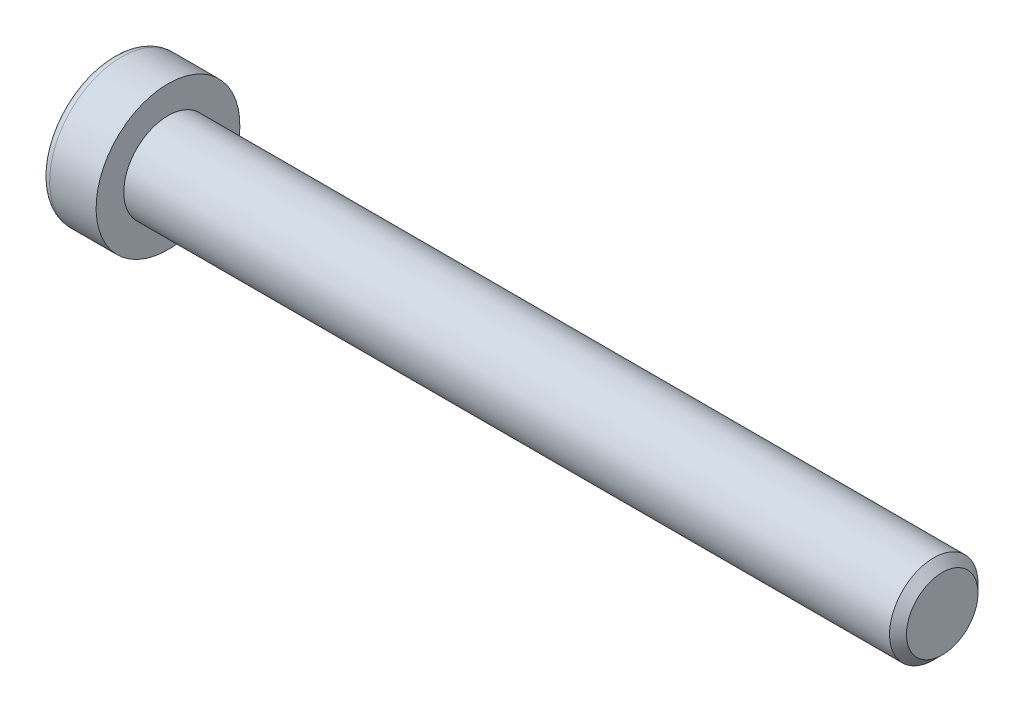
ISO-10303-21;
HEADER;
FILE_DESCRIPTION(('STEP AP214'),'2;1');
FILE_NAME('part.step','',(''),(''),'','','');
FILE_SCHEMA(('AUTOMOTIVE_DESIGN { 1 0 10303 214 1 1 1 1 }'));
ENDSEC;
DATA;
#1=APPLICATION_CONTEXT('core data for automotive mechanical design processes');
#2=APPLICATION_PROTOCOL_DEFINITION('international standard','automotive_design',2000,#1);
#3=PRODUCT_CONTEXT('',#1,'mechanical');
#4=PRODUCT('Part','Part','',(#3));
#5=PRODUCT_RELATED_PRODUCT_CATEGORY('part','',(#4));
#6=PRODUCT_DEFINITION_FORMATION('','',#4);
#7=PRODUCT_DEFINITION_CONTEXT('part definition',#1,'design');
#8=PRODUCT_DEFINITION('design','',#6,#7);
#9=PRODUCT_DEFINITION_SHAPE('','',#8);
#10=(LENGTH_UNIT() NAMED_UNIT(*) SI_UNIT(.MILLI.,.METRE.));
#11=(NAMED_UNIT(*) PLANE_ANGLE_UNIT() SI_UNIT($,.RADIAN.));
#12=(NAMED_UNIT(*) SI_UNIT($,.STERADIAN.) SOLID_ANGLE_UNIT());
#13=UNCERTAINTY_MEASURE_WITH_UNIT(LENGTH_MEASURE(1.E-05),#10,'distance_accuracy_value','');
#14=(GEOMETRIC_REPRESENTATION_CONTEXT(3) GLOBAL_UNCERTAINTY_ASSIGNED_CONTEXT((#13)) GLOBAL_UNIT_ASSIGNED_CONTEXT((#10,
#11,#12)) REPRESENTATION_CONTEXT('',''));
#15=CARTESIAN_POINT('',(0.,0.,0.));
#16=DIRECTION('',(0.,0.,1.));
#17=DIRECTION('',(1.,0.,0.));
#18=AXIS2_PLACEMENT_3D('',#15,#16,#17);
#19=CARTESIAN_POINT('',(-1.21000000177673,0.,0.));
#20=DIRECTION('',(-1.,0.,0.));
#21=DIRECTION('',(0.,0.,1.));
#22=AXIS2_PLACEMENT_3D('',#19,#20,#21);
#23=CONICAL_SURFACE('',#22,2.9040718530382,1.04719754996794);
#24=CARTESIAN_POINT('',(0.466666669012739,-1.13686837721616E-10,0.));
#25=VERTEX_POINT('',#24);
#26=VERTEX_LOOP('',#25);
#27=FACE_BOUND('',#26,.T.);
#28=CARTESIAN_POINT('',(-1.20000000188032,2.50000000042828,1.44337567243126));
#29=CARTESIAN_POINT('',(-1.16336943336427,2.50000000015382,1.31652043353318));
#30=CARTESIAN_POINT('',(-1.13005584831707,2.50000000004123,1.18857018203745));
#31=CARTESIAN_POINT('',(-1.07190798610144,2.49999999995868,0.930454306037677));
#32=CARTESIAN_POINT('',(-1.04709427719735,2.49999999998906,0.800284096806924));
#33=CARTESIAN_POINT('',(-1.00846995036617,2.50000000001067,0.541556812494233));
#34=CARTESIAN_POINT('',(-0.994402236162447,2.50000000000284,0.413039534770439));
#35=CARTESIAN_POINT('',(-0.977611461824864,2.49999999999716,0.155400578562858));
#36=CARTESIAN_POINT('',(-0.974874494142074,2.49999999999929,0.0262798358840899));
#37=CARTESIAN_POINT('',(-0.980582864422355,2.50000000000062,-0.21496841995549));
#38=CARTESIAN_POINT('',(-0.987626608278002,2.50000000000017,-0.327132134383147));
#39=CARTESIAN_POINT('',(-1.00994662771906,2.49999999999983,-0.550728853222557));
#40=CARTESIAN_POINT('',(-1.02523052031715,2.49999999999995,-0.66216108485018));
#41=CARTESIAN_POINT('',(-1.06343729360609,2.50000000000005,-0.886218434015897));
#42=CARTESIAN_POINT('',(-1.08652205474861,2.50000000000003,-0.998815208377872));
#43=CARTESIAN_POINT('',(-1.13891470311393,2.49999999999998,-1.2223298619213));
#44=CARTESIAN_POINT('',(-1.16821028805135,2.49999999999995,-1.33325060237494));
#45=CARTESIAN_POINT('',(-1.20000000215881,2.5,-1.44337567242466));
#46=B_SPLINE_CURVE_WITH_KNOTS('',3,(#28,#29,#30,#31,#32,#33,#34,#35,#36,#37,#38,#39,#40,#41,#42,
#43,#44,#45),.UNSPECIFIED.,.F.,.F.,(4,2,2,2,2,2,2,2,4),(0.,0.396270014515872,0.793492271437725,
1.18088450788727,1.56780111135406,1.90463472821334,2.24178024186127,2.58640202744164,
2.93034746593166),.UNSPECIFIED.);
#47=CARTESIAN_POINT('',(-1.20000000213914,2.49999999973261,1.44337567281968));
#48=VERTEX_POINT('',#47);
#49=CARTESIAN_POINT('',(-1.20000000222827,2.5,-1.44337567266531));
#50=VERTEX_POINT('',#49);
#51=EDGE_CURVE('E20',#48,#50,#46,.T.);
#52=ORIENTED_EDGE('',*,*,#51,.T.);
#53=CARTESIAN_POINT('',(-1.20000000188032,2.49999999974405,-1.44337567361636));
#54=CARTESIAN_POINT('',(-1.16336943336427,2.39014014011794,-1.50680329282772));
#55=CARTESIAN_POINT('',(-1.13005584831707,2.27933197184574,-1.57077841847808));
#56=CARTESIAN_POINT('',(-1.07190798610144,2.05579706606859,-1.69983635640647));
#57=CARTESIAN_POINT('',(-1.04709427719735,1.94306635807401,-1.76492146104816));
#58=CARTESIAN_POINT('',(-1.00846995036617,1.71900195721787,-1.89428510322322));
#59=CARTESIAN_POINT('',(-0.994402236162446,1.60770272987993,-1.95854374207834));
#60=CARTESIAN_POINT('',(-0.977611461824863,1.38458084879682,-2.08736322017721));
#61=CARTESIAN_POINT('',(-0.974874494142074,1.27275900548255,-2.15192359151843));
#62=CARTESIAN_POINT('',(-0.980582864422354,1.06383188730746,-2.27254771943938));
#63=CARTESIAN_POINT('',(-0.987626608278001,0.966695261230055,-2.32862957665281));
#64=CARTESIAN_POINT('',(-1.00994662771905,0.773054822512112,-2.44042793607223));
#65=CARTESIAN_POINT('',(-1.02523052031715,0.676551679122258,-2.49614405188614));
#66=CARTESIAN_POINT('',(-1.06343729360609,0.482512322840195,-2.60817272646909));
#67=CARTESIAN_POINT('',(-1.08652205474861,0.385000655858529,-2.66447111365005));
#68=CARTESIAN_POINT('',(-1.13891470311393,0.191431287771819,-2.77622844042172));
#69=CARTESIAN_POINT('',(-1.16821028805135,0.09537110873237,-2.83168881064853));
#70=CARTESIAN_POINT('',(-1.20000000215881,4.75795614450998E-10,-2.88675134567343));
#71=B_SPLINE_CURVE_WITH_KNOTS('',3,(#53,#54,#55,#56,#57,#58,#59,#60,#61,#62,#63,#64,#65,#66,#67,
#68,#69,#70),.UNSPECIFIED.,.F.,.F.,(4,2,2,2,2,2,2,2,4),(0.,0.396270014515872,0.793492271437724,
1.18088450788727,1.56780111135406,1.90463472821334,2.24178024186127,2.58640202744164,
2.93034746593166),.UNSPECIFIED.);
#72=CARTESIAN_POINT('',(-1.20000000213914,0.,-2.88675134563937));
#73=VERTEX_POINT('',#72);
#74=EDGE_CURVE('E80',#50,#73,#71,.T.);
#75=ORIENTED_EDGE('',*,*,#74,.T.);
#76=CARTESIAN_POINT('',(-1.20000000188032,-6.84219602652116E-10,-2.88675134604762));
#77=CARTESIAN_POINT('',(-1.16336943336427,-0.109859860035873,-2.8233237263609));
#78=CARTESIAN_POINT('',(-1.13005584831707,-0.220668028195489,-2.75934860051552));
#79=CARTESIAN_POINT('',(-1.07190798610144,-0.444202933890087,-2.63029066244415));
#80=CARTESIAN_POINT('',(-1.04709427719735,-0.556933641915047,-2.56520555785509));
#81=CARTESIAN_POINT('',(-1.00846995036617,-0.780998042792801,-2.43584191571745));
#82=CARTESIAN_POINT('',(-0.994402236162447,-0.892297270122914,-2.37158327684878));
#83=CARTESIAN_POINT('',(-0.977611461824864,-1.11541915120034,-2.24276379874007));
#84=CARTESIAN_POINT('',(-0.974874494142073,-1.22724099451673,-2.17820342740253));
#85=CARTESIAN_POINT('',(-0.980582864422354,-1.43616811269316,-2.05757929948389));
#86=CARTESIAN_POINT('',(-0.987626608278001,-1.53330473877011,-2.00149744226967));
#87=CARTESIAN_POINT('',(-1.00994662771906,-1.72694517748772,-1.88969908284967));
#88=CARTESIAN_POINT('',(-1.02523052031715,-1.82344832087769,-1.83398296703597));
#89=CARTESIAN_POINT('',(-1.06343729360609,-2.01748767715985,-1.72195429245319));
#90=CARTESIAN_POINT('',(-1.08652205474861,-2.1149993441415,-1.66565590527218));
#91=CARTESIAN_POINT('',(-1.13891470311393,-2.30856871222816,-1.55389857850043));
#92=CARTESIAN_POINT('',(-1.16821028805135,-2.40462889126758,-1.49843820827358));
#93=CARTESIAN_POINT('',(-1.20000000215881,-2.49999999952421,-1.44337567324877));
#94=B_SPLINE_CURVE_WITH_KNOTS('',3,(#76,#77,#78,#79,#80,#81,#82,#83,#84,#85,#86,#87,#88,#89,#90,
#91,#92,#93),.UNSPECIFIED.,.F.,.F.,(4,2,2,2,2,2,2,2,4),(0.,0.396270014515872,0.793492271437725,
1.18088450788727,1.56780111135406,1.90463472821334,2.24178024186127,2.58640202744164,
2.93034746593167),.UNSPECIFIED.);
#95=CARTESIAN_POINT('',(-1.20000000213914,-2.49999999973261,-1.44337567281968));
#96=VERTEX_POINT('',#95);
#97=EDGE_CURVE('E105',#73,#96,#94,.T.);
#98=ORIENTED_EDGE('',*,*,#97,.T.);
#99=CARTESIAN_POINT('',(-1.20000000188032,-2.50000000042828,-1.44337567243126));
#100=CARTESIAN_POINT('',(-1.16336943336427,-2.50000000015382,-1.31652043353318));
#101=CARTESIAN_POINT('',(-1.13005584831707,-2.50000000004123,-1.18857018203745));
#102=CARTESIAN_POINT('',(-1.07190798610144,-2.49999999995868,-0.93045430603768));
#103=CARTESIAN_POINT('',(-1.04709427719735,-2.49999999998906,-0.800284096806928));
#104=CARTESIAN_POINT('',(-1.00846995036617,-2.50000000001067,-0.541556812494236));
#105=CARTESIAN_POINT('',(-0.994402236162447,-2.50000000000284,-0.413039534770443));
#106=CARTESIAN_POINT('',(-0.977611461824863,-2.49999999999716,-0.155400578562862));
#107=CARTESIAN_POINT('',(-0.974874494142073,-2.49999999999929,-0.0262798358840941));
#108=CARTESIAN_POINT('',(-0.980582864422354,-2.50000000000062,0.214968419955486));
#109=CARTESIAN_POINT('',(-0.987626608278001,-2.50000000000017,0.327132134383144));
#110=CARTESIAN_POINT('',(-1.00994662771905,-2.49999999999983,0.550728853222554));
#111=CARTESIAN_POINT('',(-1.02523052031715,-2.49999999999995,0.662161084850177));
#112=CARTESIAN_POINT('',(-1.06343729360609,-2.50000000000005,0.886218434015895));
#113=CARTESIAN_POINT('',(-1.08652205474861,-2.50000000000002,0.99881520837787));
#114=CARTESIAN_POINT('',(-1.13891470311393,-2.49999999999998,1.2223298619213));
#115=CARTESIAN_POINT('',(-1.16821028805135,-2.49999999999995,1.33325060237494));
#116=CARTESIAN_POINT('',(-1.20000000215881,-2.5,1.44337567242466));
#117=B_SPLINE_CURVE_WITH_KNOTS('',3,(#99,#100,#101,#102,#103,#104,#105,#106,#107,#108,#109,#110,
#111,#112,#113,#114,#115,#116),.UNSPECIFIED.,.F.,.F.,(4,2,2,2,2,2,2,2,4),(0.,0.396270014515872,
0.793492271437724,1.18088450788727,1.56780111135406,1.90463472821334,2.24178024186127,
2.58640202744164,2.93034746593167),.UNSPECIFIED.);
#118=CARTESIAN_POINT('',(-1.20000000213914,-2.49999999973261,1.44337567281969));
#119=VERTEX_POINT('',#118);
#120=EDGE_CURVE('E129',#96,#119,#117,.T.);
#121=ORIENTED_EDGE('',*,*,#120,.T.);
#122=CARTESIAN_POINT('',(-1.20000000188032,-2.49999999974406,1.44337567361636));
#123=CARTESIAN_POINT('',(-1.16336943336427,-2.39014014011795,1.50680329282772));
#124=CARTESIAN_POINT('',(-1.13005584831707,-2.27933197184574,1.57077841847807));
#125=CARTESIAN_POINT('',(-1.07190798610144,-2.05579706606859,1.69983635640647));
#126=CARTESIAN_POINT('',(-1.04709427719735,-1.94306635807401,1.76492146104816));
#127=CARTESIAN_POINT('',(-1.00846995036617,-1.71900195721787,1.89428510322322));
#128=CARTESIAN_POINT('',(-0.994402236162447,-1.60770272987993,1.95854374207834));
#129=CARTESIAN_POINT('',(-0.977611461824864,-1.38458084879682,2.08736322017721));
#130=CARTESIAN_POINT('',(-0.974874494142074,-1.27275900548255,2.15192359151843));
#131=CARTESIAN_POINT('',(-0.980582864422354,-1.06383188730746,2.27254771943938));
#132=CARTESIAN_POINT('',(-0.987626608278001,-0.966695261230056,2.32862957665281));
#133=CARTESIAN_POINT('',(-1.00994662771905,-0.773054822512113,2.44042793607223));
#134=CARTESIAN_POINT('',(-1.02523052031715,-0.676551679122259,2.49614405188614));
#135=CARTESIAN_POINT('',(-1.06343729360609,-0.482512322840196,2.60817272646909));
#136=CARTESIAN_POINT('',(-1.08652205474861,-0.385000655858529,2.66447111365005));
#137=CARTESIAN_POINT('',(-1.13891470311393,-0.19143128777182,2.77622844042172));
#138=CARTESIAN_POINT('',(-1.16821028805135,-0.0953711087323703,2.83168881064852));
#139=CARTESIAN_POINT('',(-1.20000000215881,-4.75795563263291E-10,2.88675134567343));
#140=B_SPLINE_CURVE_WITH_KNOTS('',3,(#122,#123,#124,#125,#126,#127,#128,#129,#130,#131,#132,
#133,#134,#135,#136,#137,#138,#139),.UNSPECIFIED.,.F.,.F.,(4,2,2,2,2,2,2,2,4),(0.,
0.396270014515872,0.793492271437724,1.18088450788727,1.56780111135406,1.90463472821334,
2.24178024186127,2.58640202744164,2.93034746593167),.UNSPECIFIED.);
#141=CARTESIAN_POINT('',(-1.20000000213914,0.,2.88675134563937));
#142=VERTEX_POINT('',#141);
#143=EDGE_CURVE('E137',#119,#142,#140,.T.);
#144=ORIENTED_EDGE('',*,*,#143,.T.);
#145=CARTESIAN_POINT('',(-1.20000000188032,6.84218567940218E-10,2.88675134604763));
#146=CARTESIAN_POINT('',(-1.16336943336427,0.109859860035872,2.8233237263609));
#147=CARTESIAN_POINT('',(-1.13005584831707,0.220668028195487,2.75934860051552));
#148=CARTESIAN_POINT('',(-1.07190798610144,0.444202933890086,2.63029066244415));
#149=CARTESIAN_POINT('',(-1.04709427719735,0.556933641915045,2.56520555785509));
#150=CARTESIAN_POINT('',(-1.00846995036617,0.7809980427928,2.43584191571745));
#151=CARTESIAN_POINT('',(-0.994402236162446,0.892297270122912,2.37158327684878));
#152=CARTESIAN_POINT('',(-0.977611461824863,1.11541915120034,2.24276379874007));
#153=CARTESIAN_POINT('',(-0.974874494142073,1.22724099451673,2.17820342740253));
#154=CARTESIAN_POINT('',(-0.980582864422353,1.43616811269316,2.05757929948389));
#155=CARTESIAN_POINT('',(-0.987626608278,1.53330473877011,2.00149744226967));
#156=CARTESIAN_POINT('',(-1.00994662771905,1.72694517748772,1.88969908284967));
#157=CARTESIAN_POINT('',(-1.02523052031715,1.82344832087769,1.83398296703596));
#158=CARTESIAN_POINT('',(-1.06343729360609,2.01748767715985,1.72195429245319));
#159=CARTESIAN_POINT('',(-1.08652205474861,2.1149993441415,1.66565590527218));
#160=CARTESIAN_POINT('',(-1.13891470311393,2.30856871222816,1.55389857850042));
#161=CARTESIAN_POINT('',(-1.16821028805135,2.40462889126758,1.49843820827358));
#162=CARTESIAN_POINT('',(-1.2000000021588,2.49999999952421,1.44337567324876));
#163=B_SPLINE_CURVE_WITH_KNOTS('',3,(#145,#146,#147,#148,#149,#150,#151,#152,#153,#154,#155,
#156,#157,#158,#159,#160,#161,#162),.UNSPECIFIED.,.F.,.F.,(4,2,2,2,2,2,2,2,4),(0.,
0.396270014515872,0.793492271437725,1.18088450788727,1.56780111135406,1.90463472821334,
2.24178024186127,2.58640202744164,2.93034746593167),.UNSPECIFIED.);
#164=EDGE_CURVE('E82',#142,#48,#163,.T.);
#165=ORIENTED_EDGE('',*,*,#164,.T.);
#166=EDGE_LOOP('',(#52,#75,#98,#121,#144,#165));
#167=FACE_BOUND('',#166,.T.);
#168=ADVANCED_FACE('F16',(#27,#167),#23,.F.);
#169=CARTESIAN_POINT('',(-5.,2.5,1.44337567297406));
#170=DIRECTION('',(0.,1.,0.));
#171=DIRECTION('',(0.,0.,1.));
#172=AXIS2_PLACEMENT_3D('',#169,#170,#171);
#173=PLANE('',#172);
#174=DIRECTION('',(1.,0.,0.));
#175=VECTOR('',#174,1.);
#176=CARTESIAN_POINT('',(-5.,2.5,1.44337567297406));
#177=LINE('',#176,#175);
#178=CARTESIAN_POINT('',(-5.,2.5,1.44337567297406));
#179=VERTEX_POINT('',#178);
#180=EDGE_CURVE('E84',#48,#179,#177,.F.);
#181=ORIENTED_EDGE('',*,*,#180,.T.);
#182=DIRECTION('',(0.,0.,1.));
#183=VECTOR('',#182,1.);
#184=CARTESIAN_POINT('',(-5.,2.5,0.));
#185=LINE('',#184,#183);
#186=CARTESIAN_POINT('',(-5.,2.5,-1.44337567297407));
#187=VERTEX_POINT('',#186);
#188=EDGE_CURVE('E89',#187,#179,#185,.T.);
#189=ORIENTED_EDGE('',*,*,#188,.F.);
#190=DIRECTION('',(1.,0.,0.));
#191=VECTOR('',#190,1.);
#192=CARTESIAN_POINT('',(-5.,2.5,-1.44337567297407));
#193=LINE('',#192,#191);
#194=EDGE_CURVE('E87',#187,#50,#193,.T.);
#195=ORIENTED_EDGE('',*,*,#194,.T.);
#196=ORIENTED_EDGE('',*,*,#51,.F.);
#197=EDGE_LOOP('',(#181,#189,#195,#196));
#198=FACE_BOUND('',#197,.T.);
#199=ADVANCED_FACE('F76',(#198),#173,.F.);
#200=CARTESIAN_POINT('',(-5.,0.,2.88675134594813));
#201=DIRECTION('',(0.,0.500000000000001,0.866025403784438));
#202=DIRECTION('',(0.,-0.866025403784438,0.500000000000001));
#203=AXIS2_PLACEMENT_3D('',#200,#201,#202);
#204=PLANE('',#203);
#205=DIRECTION('',(1.,0.,0.));
#206=VECTOR('',#205,1.);
#207=CARTESIAN_POINT('',(-5.,0.,2.88675134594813));
#208=LINE('',#207,#206);
#209=CARTESIAN_POINT('',(-5.,0.,2.88675134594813));
#210=VERTEX_POINT('',#209);
#211=EDGE_CURVE('E141',#142,#210,#208,.F.);
#212=ORIENTED_EDGE('',*,*,#211,.T.);
#213=DIRECTION('',(0.,-0.866025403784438,0.500000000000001));
#214=VECTOR('',#213,1.);
#215=CARTESIAN_POINT('',(-5.,2.5,1.44337567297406));
#216=LINE('',#215,#214);
#217=EDGE_CURVE('E95',#179,#210,#216,.T.);
#218=ORIENTED_EDGE('',*,*,#217,.F.);
#219=ORIENTED_EDGE('',*,*,#180,.F.);
#220=ORIENTED_EDGE('',*,*,#164,.F.);
#221=EDGE_LOOP('',(#212,#218,#219,#220));
#222=FACE_BOUND('',#221,.T.);
#223=ADVANCED_FACE('F145',(#222),#204,.F.);
#224=CARTESIAN_POINT('',(-5.,-2.5,1.44337567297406));
#225=DIRECTION('',(0.,-0.5,0.866025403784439));
#226=DIRECTION('',(0.,-0.866025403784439,-0.5));
#227=AXIS2_PLACEMENT_3D('',#224,#225,#226);
#228=PLANE('',#227);
#229=DIRECTION('',(1.,0.,0.));
#230=VECTOR('',#229,1.);
#231=CARTESIAN_POINT('',(-5.,-2.5,1.44337567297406));
#232=LINE('',#231,#230);
#233=CARTESIAN_POINT('',(-5.,-2.5,1.44337567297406));
#234=VERTEX_POINT('',#233);
#235=EDGE_CURVE('E136',#119,#234,#232,.F.);
#236=ORIENTED_EDGE('',*,*,#235,.T.);
#237=DIRECTION('',(0.,-0.866025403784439,-0.5));
#238=VECTOR('',#237,1.);
#239=CARTESIAN_POINT('',(-5.,0.,2.88675134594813));
#240=LINE('',#239,#238);
#241=EDGE_CURVE('E224',#210,#234,#240,.T.);
#242=ORIENTED_EDGE('',*,*,#241,.F.);
#243=ORIENTED_EDGE('',*,*,#211,.F.);
#244=ORIENTED_EDGE('',*,*,#143,.F.);
#245=EDGE_LOOP('',(#236,#242,#243,#244));
#246=FACE_BOUND('',#245,.T.);
#247=ADVANCED_FACE('F125',(#246),#228,.F.);
#248=CARTESIAN_POINT('',(-5.,-2.5,-1.44337567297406));
#249=DIRECTION('',(0.,-1.,0.));
#250=DIRECTION('',(0.,0.,-1.));
#251=AXIS2_PLACEMENT_3D('',#248,#249,#250);
#252=PLANE('',#251);
#253=DIRECTION('',(1.,0.,0.));
#254=VECTOR('',#253,1.);
#255=CARTESIAN_POINT('',(-5.,-2.5,-1.44337567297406));
#256=LINE('',#255,#254);
#257=CARTESIAN_POINT('',(-5.,-2.5,-1.44337567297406));
#258=VERTEX_POINT('',#257);
#259=EDGE_CURVE('E135',#96,#258,#256,.F.);
#260=ORIENTED_EDGE('',*,*,#259,.T.);
#261=DIRECTION('',(0.,0.,1.));
#262=VECTOR('',#261,1.);
#263=CARTESIAN_POINT('',(-5.,-2.5,0.));
#264=LINE('',#263,#262);
#265=EDGE_CURVE('E221',#234,#258,#264,.F.);
#266=ORIENTED_EDGE('',*,*,#265,.F.);
#267=ORIENTED_EDGE('',*,*,#235,.F.);
#268=ORIENTED_EDGE('',*,*,#120,.F.);
#269=EDGE_LOOP('',(#260,#266,#267,#268));
#270=FACE_BOUND('',#269,.T.);
#271=ADVANCED_FACE('F121',(#270),#252,.F.);
#272=CARTESIAN_POINT('',(-5.,0.,-2.88675134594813));
#273=DIRECTION('',(0.,-0.5,-0.866025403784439));
#274=DIRECTION('',(0.,0.866025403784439,-0.5));
#275=AXIS2_PLACEMENT_3D('',#272,#273,#274);
#276=PLANE('',#275);
#277=DIRECTION('',(1.,0.,0.));
#278=VECTOR('',#277,1.);
#279=CARTESIAN_POINT('',(-5.,0.,-2.88675134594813));
#280=LINE('',#279,#278);
#281=CARTESIAN_POINT('',(-5.,0.,-2.88675134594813));
#282=VERTEX_POINT('',#281);
#283=EDGE_CURVE('E38',#73,#282,#280,.F.);
#284=ORIENTED_EDGE('',*,*,#283,.T.);
#285=DIRECTION('',(0.,0.866025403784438,-0.500000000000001));
#286=VECTOR('',#285,1.);
#287=CARTESIAN_POINT('',(-5.,-2.5,-1.44337567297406));
#288=LINE('',#287,#286);
#289=EDGE_CURVE('E218',#258,#282,#288,.T.);
#290=ORIENTED_EDGE('',*,*,#289,.F.);
#291=ORIENTED_EDGE('',*,*,#259,.F.);
#292=ORIENTED_EDGE('',*,*,#97,.F.);
#293=EDGE_LOOP('',(#284,#290,#291,#292));
#294=FACE_BOUND('',#293,.T.);
#295=ADVANCED_FACE('F115',(#294),#276,.F.);
#296=CARTESIAN_POINT('',(-5.,2.5,-1.44337567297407));
#297=DIRECTION('',(0.,0.5,-0.866025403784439));
#298=DIRECTION('',(0.,0.866025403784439,0.5));
#299=AXIS2_PLACEMENT_3D('',#296,#297,#298);
#300=PLANE('',#299);
#301=ORIENTED_EDGE('',*,*,#194,.F.);
#302=DIRECTION('',(0.,0.866025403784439,0.5));
#303=VECTOR('',#302,1.);
#304=CARTESIAN_POINT('',(-5.,0.,-2.88675134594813));
#305=LINE('',#304,#303);
#306=EDGE_CURVE('E216',#282,#187,#305,.T.);
#307=ORIENTED_EDGE('',*,*,#306,.F.);
#308=ORIENTED_EDGE('',*,*,#283,.F.);
#309=ORIENTED_EDGE('',*,*,#74,.F.);
#310=EDGE_LOOP('',(#301,#307,#308,#309));
#311=FACE_BOUND('',#310,.T.);
#312=ADVANCED_FACE('F93',(#311),#300,.F.);
#313=CARTESIAN_POINT('',(-5.,4.69337567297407,0.));
#314=DIRECTION('',(-1.,0.,0.));
#315=DIRECTION('',(0.,0.,1.));
#316=AXIS2_PLACEMENT_3D('',#313,#314,#315);
#317=PLANE('',#316);
#318=ORIENTED_EDGE('',*,*,#289,.T.);
#319=ORIENTED_EDGE('',*,*,#306,.T.);
#320=ORIENTED_EDGE('',*,*,#188,.T.);
#321=ORIENTED_EDGE('',*,*,#217,.T.);
#322=ORIENTED_EDGE('',*,*,#241,.T.);
#323=ORIENTED_EDGE('',*,*,#265,.T.);
#324=EDGE_LOOP('',(#318,#319,#320,#321,#322,#323));
#325=FACE_BOUND('',#324,.T.);
#326=CARTESIAN_POINT('',(-5.,0.,0.));
#327=DIRECTION('',(1.,0.,0.));
#328=DIRECTION('',(0.,1.,0.));
#329=AXIS2_PLACEMENT_3D('',#326,#327,#328);
#330=CIRCLE('',#329,5.7);
#331=CARTESIAN_POINT('',(-5.,5.7,0.));
#332=VERTEX_POINT('',#331);
#333=EDGE_CURVE('E193',#332,#332,#330,.T.);
#334=ORIENTED_EDGE('',*,*,#333,.F.);
#335=EDGE_LOOP('',(#334));
#336=FACE_BOUND('',#335,.T.);
#337=ADVANCED_FACE('F114',(#325,#336),#317,.T.);
#338=CARTESIAN_POINT('',(-4.2,0.,0.));
#339=DIRECTION('',(1.,0.,0.));
#340=DIRECTION('',(0.,0.,-1.));
#341=AXIS2_PLACEMENT_3D('',#338,#339,#340);
#342=TOROIDAL_SURFACE('',#341,5.7,0.8);
#343=CARTESIAN_POINT('',(-4.2,0.,0.));
#344=DIRECTION('',(1.,0.,0.));
#345=DIRECTION('',(0.,1.,0.));
#346=AXIS2_PLACEMENT_3D('',#343,#344,#345);
#347=CIRCLE('',#346,6.5);
#348=CARTESIAN_POINT('',(-4.2,6.5,0.));
#349=VERTEX_POINT('',#348);
#350=EDGE_CURVE('E234',#349,#349,#347,.T.);
#351=ORIENTED_EDGE('',*,*,#350,.F.);
#352=EDGE_LOOP('',(#351));
#353=FACE_BOUND('',#352,.T.);
#354=ORIENTED_EDGE('',*,*,#333,.T.);
#355=EDGE_LOOP('',(#354));
#356=FACE_BOUND('',#355,.T.);
#357=ADVANCED_FACE('F177',(#353,#356),#342,.T.);
#358=CARTESIAN_POINT('',(-2.5,0.,0.));
#359=DIRECTION('',(1.,0.,0.));
#360=DIRECTION('',(0.,1.,0.));
#361=AXIS2_PLACEMENT_3D('',#358,#359,#360);
#362=CYLINDRICAL_SURFACE('',#361,6.5);
#363=ORIENTED_EDGE('',*,*,#350,.T.);
#364=EDGE_LOOP('',(#363));
#365=FACE_BOUND('',#364,.T.);
#366=CARTESIAN_POINT('',(0.,0.,0.));
#367=DIRECTION('',(1.,0.,0.));
#368=DIRECTION('',(0.,1.,0.));
#369=AXIS2_PLACEMENT_3D('',#366,#367,#368);
#370=CIRCLE('',#369,6.5);
#371=CARTESIAN_POINT('',(0.,6.5,0.));
#372=VERTEX_POINT('',#371);
#373=EDGE_CURVE('E103',#372,#372,#370,.T.);
#374=ORIENTED_EDGE('',*,*,#373,.F.);
#375=EDGE_LOOP('',(#374));
#376=FACE_BOUND('',#375,.T.);
#377=ADVANCED_FACE('F174',(#365,#376),#362,.T.);
#378=CARTESIAN_POINT('',(70.,2.,0.));
#379=DIRECTION('',(1.,0.,0.));
#380=DIRECTION('',(0.,0.,-1.));
#381=AXIS2_PLACEMENT_3D('',#378,#379,#380);
#382=PLANE('',#381);
#383=CARTESIAN_POINT('',(70.0000000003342,0.,0.));
#384=DIRECTION('',(-1.,0.,0.));
#385=DIRECTION('',(0.,0.,1.));
#386=AXIS2_PLACEMENT_3D('',#383,#384,#385);
#387=CIRCLE('',#386,3.23318750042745);
#388=CARTESIAN_POINT('',(70.0000000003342,0.,3.23318750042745));
#389=VERTEX_POINT('',#388);
#390=EDGE_CURVE('E230',#389,#389,#387,.T.);
#391=ORIENTED_EDGE('',*,*,#390,.F.);
#392=EDGE_LOOP('',(#391));
#393=FACE_BOUND('',#392,.T.);
#394=ADVANCED_FACE('F170',(#393),#382,.T.);
#395=CARTESIAN_POINT('',(0.,5.25,0.));
#396=DIRECTION('',(1.,0.,0.));
#397=DIRECTION('',(0.,0.,-1.));
#398=AXIS2_PLACEMENT_3D('',#395,#396,#397);
#399=PLANE('',#398);
#400=CARTESIAN_POINT('',(0.,0.,0.));
#401=DIRECTION('',(1.,0.,0.));
#402=DIRECTION('',(0.,1.,0.));
#403=AXIS2_PLACEMENT_3D('',#400,#401,#402);
#404=CIRCLE('',#403,4.00000000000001);
#405=CARTESIAN_POINT('',(0.,4.00000000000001,0.));
#406=VERTEX_POINT('',#405);
#407=EDGE_CURVE('E29',#406,#406,#404,.T.);
#408=ORIENTED_EDGE('',*,*,#407,.F.);
#409=EDGE_LOOP('',(#408));
#410=FACE_BOUND('',#409,.T.);
#411=ORIENTED_EDGE('',*,*,#373,.T.);
#412=EDGE_LOOP('',(#411));
#413=FACE_BOUND('',#412,.T.);
#414=ADVANCED_FACE('F163',(#410,#413),#399,.T.);
#415=CARTESIAN_POINT('',(69.2331874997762,0.,0.));
#416=DIRECTION('',(-1.,0.,0.));
#417=DIRECTION('',(0.,0.,1.));
#418=AXIS2_PLACEMENT_3D('',#415,#416,#417);
#419=CONICAL_SURFACE('',#418,3.99999999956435,0.78539816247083);
#420=ORIENTED_EDGE('',*,*,#390,.T.);
#421=EDGE_LOOP('',(#420));
#422=FACE_BOUND('',#421,.T.);
#423=CARTESIAN_POINT('',(69.2331875,0.,0.));
#424=DIRECTION('',(1.,0.,0.));
#425=DIRECTION('',(0.,1.,0.));
#426=AXIS2_PLACEMENT_3D('',#423,#424,#425);
#427=CIRCLE('',#426,4.00000000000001);
#428=CARTESIAN_POINT('',(69.2331875,4.00000000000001,0.));
#429=VERTEX_POINT('',#428);
#430=EDGE_CURVE('E11',#429,#429,#427,.F.);
#431=ORIENTED_EDGE('',*,*,#430,.F.);
#432=EDGE_LOOP('',(#431));
#433=FACE_BOUND('',#432,.T.);
#434=ADVANCED_FACE('F156',(#422,#433),#419,.T.);
#435=CARTESIAN_POINT('',(59.,0.,0.));
#436=DIRECTION('',(1.,0.,0.));
#437=DIRECTION('',(0.,1.,0.));
#438=AXIS2_PLACEMENT_3D('',#435,#436,#437);
#439=CYLINDRICAL_SURFACE('',#438,4.00000000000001);
#440=ORIENTED_EDGE('',*,*,#430,.T.);
#441=EDGE_LOOP('',(#440));
#442=FACE_BOUND('',#441,.T.);
#443=ORIENTED_EDGE('',*,*,#407,.T.);
#444=EDGE_LOOP('',(#443));
#445=FACE_BOUND('',#444,.T.);
#446=ADVANCED_FACE('F154',(#442,#445),#439,.T.);
#447=CLOSED_SHELL('',(#168,#199,#223,#247,#271,#295,#312,#337,#357,#377,#394,#414,#434,#446));
#448=MANIFOLD_SOLID_BREP('B1',#447);
#449=ADVANCED_BREP_SHAPE_REPRESENTATION('',(#18,#448),#14);
#450=SHAPE_DEFINITION_REPRESENTATION(#9,#449);
ENDSEC;
END-ISO-10303-21;
